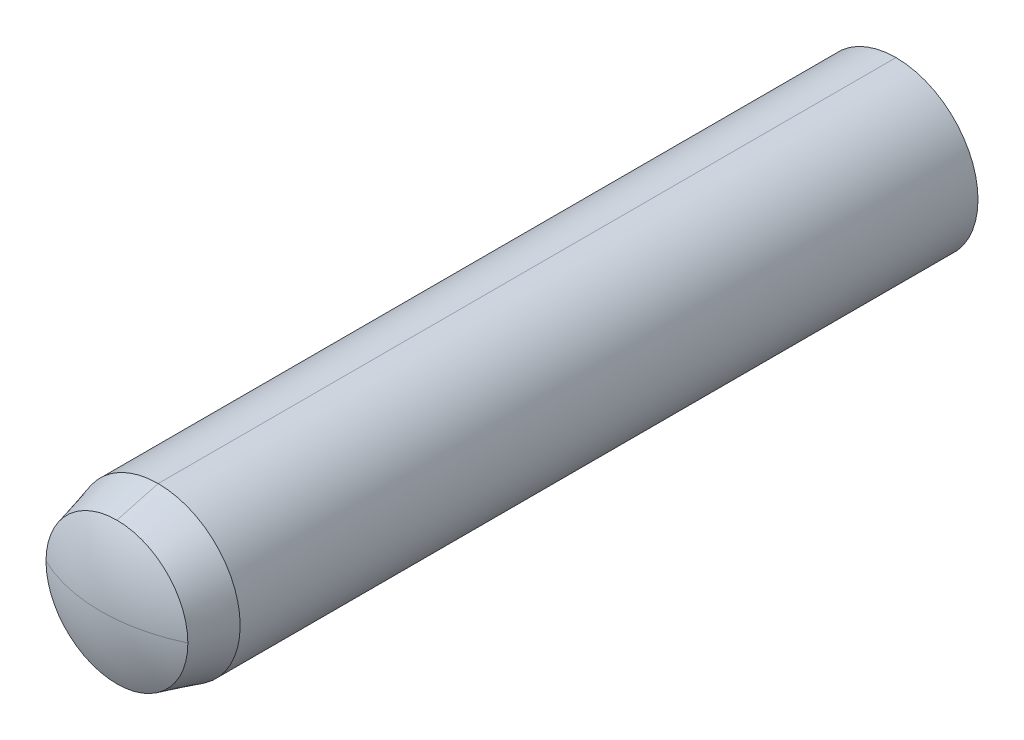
ISO-10303-21;
HEADER;
FILE_DESCRIPTION(('STEP AP214'),'2;1');
FILE_NAME('part.step','',(''),(''),'','','');
FILE_SCHEMA(('AUTOMOTIVE_DESIGN { 1 0 10303 214 1 1 1 1 }'));
ENDSEC;
DATA;
#1=APPLICATION_CONTEXT('core data for automotive mechanical design processes');
#2=APPLICATION_PROTOCOL_DEFINITION('international standard','automotive_design',2000,#1);
#3=PRODUCT_CONTEXT('',#1,'mechanical');
#4=PRODUCT('Part','Part','',(#3));
#5=PRODUCT_RELATED_PRODUCT_CATEGORY('part','',(#4));
#6=PRODUCT_DEFINITION_FORMATION('','',#4);
#7=PRODUCT_DEFINITION_CONTEXT('part definition',#1,'design');
#8=PRODUCT_DEFINITION('design','',#6,#7);
#9=PRODUCT_DEFINITION_SHAPE('','',#8);
#10=(LENGTH_UNIT() NAMED_UNIT(*) SI_UNIT(.MILLI.,.METRE.));
#11=(NAMED_UNIT(*) PLANE_ANGLE_UNIT() SI_UNIT($,.RADIAN.));
#12=(NAMED_UNIT(*) SI_UNIT($,.STERADIAN.) SOLID_ANGLE_UNIT());
#13=UNCERTAINTY_MEASURE_WITH_UNIT(LENGTH_MEASURE(1.E-05),#10,'distance_accuracy_value','');
#14=(GEOMETRIC_REPRESENTATION_CONTEXT(3) GLOBAL_UNCERTAINTY_ASSIGNED_CONTEXT((#13)) GLOBAL_UNIT_ASSIGNED_CONTEXT((#10,
#11,#12)) REPRESENTATION_CONTEXT('',''));
#15=CARTESIAN_POINT('',(0.,0.,0.));
#16=DIRECTION('',(0.,0.,1.));
#17=DIRECTION('',(1.,0.,0.));
#18=AXIS2_PLACEMENT_3D('',#15,#16,#17);
#19=CARTESIAN_POINT('',(0.,0.,9.6));
#20=DIRECTION('',(0.,0.,1.));
#21=DIRECTION('',(0.,1.,0.));
#22=AXIS2_PLACEMENT_3D('',#19,#20,#21);
#23=CYLINDRICAL_SURFACE('',#22,2.);
#24=CARTESIAN_POINT('',(0.,0.,18.6));
#25=DIRECTION('',(0.,0.,1.));
#26=DIRECTION('',(0.,-1.,0.));
#27=AXIS2_PLACEMENT_3D('',#24,#25,#26);
#28=CIRCLE('',#27,2.);
#29=CARTESIAN_POINT('',(0.,-2.,18.6));
#30=VERTEX_POINT('',#29);
#31=CARTESIAN_POINT('',(0.,2.,18.6));
#32=VERTEX_POINT('',#31);
#33=EDGE_CURVE('E102',#30,#32,#28,.T.);
#34=ORIENTED_EDGE('',*,*,#33,.F.);
#35=DIRECTION('',(0.,0.,-1.));
#36=VECTOR('',#35,1.);
#37=CARTESIAN_POINT('',(0.,-2.,18.6));
#38=LINE('',#37,#36);
#39=CARTESIAN_POINT('',(0.,-2.,0.6));
#40=VERTEX_POINT('',#39);
#41=EDGE_CURVE('E25',#30,#40,#38,.T.);
#42=ORIENTED_EDGE('',*,*,#41,.T.);
#43=CARTESIAN_POINT('',(0.,0.,0.6));
#44=DIRECTION('',(0.,0.,-1.));
#45=DIRECTION('',(1.,0.,0.));
#46=AXIS2_PLACEMENT_3D('',#43,#44,#45);
#47=CIRCLE('',#46,2.);
#48=CARTESIAN_POINT('',(2.,0.,0.6));
#49=VERTEX_POINT('',#48);
#50=EDGE_CURVE('E144',#49,#40,#47,.T.);
#51=ORIENTED_EDGE('',*,*,#50,.F.);
#52=CARTESIAN_POINT('',(0.,0.,0.6));
#53=DIRECTION('',(0.,0.,-1.));
#54=DIRECTION('',(0.,1.,0.));
#55=AXIS2_PLACEMENT_3D('',#52,#53,#54);
#56=CIRCLE('',#55,2.);
#57=CARTESIAN_POINT('',(0.,2.,0.6));
#58=VERTEX_POINT('',#57);
#59=EDGE_CURVE('E131',#58,#49,#56,.T.);
#60=ORIENTED_EDGE('',*,*,#59,.F.);
#61=DIRECTION('',(0.,0.,1.));
#62=VECTOR('',#61,1.);
#63=CARTESIAN_POINT('',(0.,2.,0.6));
#64=LINE('',#63,#62);
#65=EDGE_CURVE('E11',#58,#32,#64,.T.);
#66=ORIENTED_EDGE('',*,*,#65,.T.);
#67=EDGE_LOOP('',(#34,#42,#51,#60,#66));
#68=FACE_BOUND('',#67,.T.);
#69=ADVANCED_FACE('F16',(#68),#23,.T.);
#70=CARTESIAN_POINT('',(0.,0.,9.6));
#71=DIRECTION('',(0.,0.,1.));
#72=DIRECTION('',(0.,1.,0.));
#73=AXIS2_PLACEMENT_3D('',#70,#71,#72);
#74=CYLINDRICAL_SURFACE('',#73,2.);
#75=CARTESIAN_POINT('',(0.,0.,0.6));
#76=DIRECTION('',(0.,0.,-1.));
#77=DIRECTION('',(-1.,0.,0.));
#78=AXIS2_PLACEMENT_3D('',#75,#76,#77);
#79=CIRCLE('',#78,2.);
#80=CARTESIAN_POINT('',(-2.,0.,0.6));
#81=VERTEX_POINT('',#80);
#82=EDGE_CURVE('E135',#81,#58,#79,.T.);
#83=ORIENTED_EDGE('',*,*,#82,.F.);
#84=CARTESIAN_POINT('',(0.,0.,0.6));
#85=DIRECTION('',(0.,0.,-1.));
#86=DIRECTION('',(0.,-1.,0.));
#87=AXIS2_PLACEMENT_3D('',#84,#85,#86);
#88=CIRCLE('',#87,2.);
#89=EDGE_CURVE('E149',#40,#81,#88,.T.);
#90=ORIENTED_EDGE('',*,*,#89,.F.);
#91=ORIENTED_EDGE('',*,*,#41,.F.);
#92=CARTESIAN_POINT('',(0.,0.,18.6));
#93=DIRECTION('',(0.,0.,1.));
#94=DIRECTION('',(0.,1.,0.));
#95=AXIS2_PLACEMENT_3D('',#92,#93,#94);
#96=CIRCLE('',#95,2.);
#97=EDGE_CURVE('E100',#32,#30,#96,.T.);
#98=ORIENTED_EDGE('',*,*,#97,.F.);
#99=ORIENTED_EDGE('',*,*,#65,.F.);
#100=EDGE_LOOP('',(#83,#90,#91,#98,#99));
#101=FACE_BOUND('',#100,.T.);
#102=ADVANCED_FACE('F159',(#101),#74,.T.);
#103=CARTESIAN_POINT('',(0.,0.,19.10318541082));
#104=DIRECTION('',(0.,0.,-1.));
#105=DIRECTION('',(0.,1.,0.));
#106=AXIS2_PLACEMENT_3D('',#103,#104,#105);
#107=CONICAL_SURFACE('',#106,1.865171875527,0.2617993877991);
#108=ORIENTED_EDGE('',*,*,#97,.T.);
#109=DIRECTION('',(0.,-0.258819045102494,-0.965925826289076));
#110=VECTOR('',#109,1.);
#111=CARTESIAN_POINT('',(0.,-1.730343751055,19.60637082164));
#112=LINE('',#111,#110);
#113=CARTESIAN_POINT('',(0.,-1.730343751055,19.60637082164));
#114=VERTEX_POINT('',#113);
#115=EDGE_CURVE('E97',#114,#30,#112,.T.);
#116=ORIENTED_EDGE('',*,*,#115,.F.);
#117=CARTESIAN_POINT('',(0.,0.,19.60637082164));
#118=DIRECTION('',(0.,0.,1.));
#119=DIRECTION('',(-1.,0.,0.));
#120=AXIS2_PLACEMENT_3D('',#117,#118,#119);
#121=CIRCLE('',#120,1.730343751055);
#122=CARTESIAN_POINT('',(-1.730343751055,0.,19.60637082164));
#123=VERTEX_POINT('',#122);
#124=EDGE_CURVE('E99',#123,#114,#121,.T.);
#125=ORIENTED_EDGE('',*,*,#124,.F.);
#126=CARTESIAN_POINT('',(0.,0.,19.60637082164));
#127=DIRECTION('',(0.,0.,1.));
#128=DIRECTION('',(0.,1.,0.));
#129=AXIS2_PLACEMENT_3D('',#126,#127,#128);
#130=CIRCLE('',#129,1.730343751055);
#131=CARTESIAN_POINT('',(0.,1.730343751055,19.60637082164));
#132=VERTEX_POINT('',#131);
#133=EDGE_CURVE('E117',#132,#123,#130,.T.);
#134=ORIENTED_EDGE('',*,*,#133,.F.);
#135=DIRECTION('',(0.,-0.258819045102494,0.965925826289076));
#136=VECTOR('',#135,1.);
#137=CARTESIAN_POINT('',(0.,2.,18.6));
#138=LINE('',#137,#136);
#139=EDGE_CURVE('E55',#32,#132,#138,.T.);
#140=ORIENTED_EDGE('',*,*,#139,.F.);
#141=EDGE_LOOP('',(#108,#116,#125,#134,#140));
#142=FACE_BOUND('',#141,.T.);
#143=ADVANCED_FACE('F98',(#142),#107,.T.);
#144=CARTESIAN_POINT('',(0.,0.,19.10318541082));
#145=DIRECTION('',(0.,0.,-1.));
#146=DIRECTION('',(0.,1.,0.));
#147=AXIS2_PLACEMENT_3D('',#144,#145,#146);
#148=CONICAL_SURFACE('',#147,1.865171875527,0.2617993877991);
#149=CARTESIAN_POINT('',(0.,0.,19.60637082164));
#150=DIRECTION('',(0.,0.,1.));
#151=DIRECTION('',(1.,0.,0.));
#152=AXIS2_PLACEMENT_3D('',#149,#150,#151);
#153=CIRCLE('',#152,1.730343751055);
#154=CARTESIAN_POINT('',(1.730343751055,0.,19.60637082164));
#155=VERTEX_POINT('',#154);
#156=EDGE_CURVE('E106',#155,#132,#153,.T.);
#157=ORIENTED_EDGE('',*,*,#156,.F.);
#158=CARTESIAN_POINT('',(0.,0.,19.60637082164));
#159=DIRECTION('',(0.,0.,1.));
#160=DIRECTION('',(0.,-1.,0.));
#161=AXIS2_PLACEMENT_3D('',#158,#159,#160);
#162=CIRCLE('',#161,1.730343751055);
#163=EDGE_CURVE('E67',#114,#155,#162,.T.);
#164=ORIENTED_EDGE('',*,*,#163,.F.);
#165=ORIENTED_EDGE('',*,*,#115,.T.);
#166=ORIENTED_EDGE('',*,*,#33,.T.);
#167=ORIENTED_EDGE('',*,*,#139,.T.);
#168=EDGE_LOOP('',(#157,#164,#165,#166,#167));
#169=FACE_BOUND('',#168,.T.);
#170=ADVANCED_FACE('F104',(#169),#148,.T.);
#171=CARTESIAN_POINT('',(0.,0.,16.));
#172=DIRECTION('',(0.,1.,0.));
#173=DIRECTION('',(0.901592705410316,0.,-0.432585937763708));
#174=AXIS2_PLACEMENT_3D('',#171,#172,#173);
#175=SPHERICAL_SURFACE('',#174,4.);
#176=ORIENTED_EDGE('',*,*,#124,.T.);
#177=ORIENTED_EDGE('',*,*,#163,.T.);
#178=CARTESIAN_POINT('',(0.,0.,16.));
#179=DIRECTION('',(0.,1.,0.));
#180=DIRECTION('',(-0.432585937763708,0.,0.901592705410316));
#181=AXIS2_PLACEMENT_3D('',#178,#179,#180);
#182=CIRCLE('',#181,4.);
#183=EDGE_CURVE('E110',#123,#155,#182,.T.);
#184=ORIENTED_EDGE('',*,*,#183,.F.);
#185=EDGE_LOOP('',(#176,#177,#184));
#186=FACE_BOUND('',#185,.T.);
#187=ADVANCED_FACE('F109',(#186),#175,.T.);
#188=CARTESIAN_POINT('',(0.,0.,16.));
#189=DIRECTION('',(0.,1.,0.));
#190=DIRECTION('',(0.,0.,-1.));
#191=AXIS2_PLACEMENT_3D('',#188,#189,#190);
#192=SPHERICAL_SURFACE('',#191,4.);
#193=ORIENTED_EDGE('',*,*,#156,.T.);
#194=ORIENTED_EDGE('',*,*,#133,.T.);
#195=ORIENTED_EDGE('',*,*,#183,.T.);
#196=EDGE_LOOP('',(#193,#194,#195));
#197=FACE_BOUND('',#196,.T.);
#198=ADVANCED_FACE('F175',(#197),#192,.T.);
#199=CARTESIAN_POINT('',(2.031761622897,0.1278276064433,0.622471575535));
#200=CARTESIAN_POINT('',(1.419309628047,0.08929539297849,0.2325137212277));
#201=CARTESIAN_POINT('',(0.7253758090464,0.04563677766,0.01991295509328));
#202=CARTESIAN_POINT('',(0.,0.,0.));
#203=CARTESIAN_POINT('',(2.110426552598,-1.12251564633,0.622471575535));
#204=CARTESIAN_POINT('',(1.474261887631,-0.784145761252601,0.2325137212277));
#205=CARTESIAN_POINT('',(0.7534606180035,-0.4007584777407,0.01991295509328));
#206=CARTESIAN_POINT('',(0.,0.,0.));
#207=CARTESIAN_POINT('',(1.252815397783,-2.035778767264,0.622471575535));
#208=CARTESIAN_POINT('',(0.875168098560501,-1.422115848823,0.2325137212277));
#209=CARTESIAN_POINT('',(0.4472778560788,-0.7268100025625,0.01991295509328));
#210=CARTESIAN_POINT('',(0.,0.,0.));
#211=CARTESIAN_POINT('',(0.,-2.035778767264,0.622471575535));
#212=CARTESIAN_POINT('',(0.,-1.422115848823,0.2325137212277));
#213=CARTESIAN_POINT('',(0.,-0.7268100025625,0.01991295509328));
#214=CARTESIAN_POINT('',(0.,0.,0.));
#215=CARTESIAN_POINT('',(-1.252815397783,-2.035778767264,0.622471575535));
#216=CARTESIAN_POINT('',(-0.875168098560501,-1.422115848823,0.2325137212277));
#217=CARTESIAN_POINT('',(-0.4472778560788,-0.7268100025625,0.01991295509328));
#218=CARTESIAN_POINT('',(0.,0.,0.));
#219=CARTESIAN_POINT('',(-2.110426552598,-1.12251564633,0.622471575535));
#220=CARTESIAN_POINT('',(-1.474261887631,-0.784145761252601,0.2325137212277));
#221=CARTESIAN_POINT('',(-0.7534606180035,-0.4007584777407,0.01991295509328));
#222=CARTESIAN_POINT('',(0.,0.,0.));
#223=CARTESIAN_POINT('',(-2.031761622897,0.1278276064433,0.622471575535));
#224=CARTESIAN_POINT('',(-1.419309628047,0.08929539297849,0.2325137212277));
#225=CARTESIAN_POINT('',(-0.7253758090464,0.04563677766,0.01991295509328));
#226=CARTESIAN_POINT('',(0.,0.,0.));
#227=(BOUNDED_SURFACE() B_SPLINE_SURFACE(3,3,((#199,#200,#201,#202),(#203,#204,#205,#206),(#207,
#208,#209,#210),(#211,#212,#213,#214),(#215,#216,#217,#218),(#219,#220,#221,#222),(#223,#224,
#225,#226)),.UNSPECIFIED.,.F.,.F.,.F.) B_SPLINE_SURFACE_WITH_KNOTS((4,3,4),(4,4),(0.,1.,2.),(0.,
1.),.UNSPECIFIED.) GEOMETRIC_REPRESENTATION_ITEM() RATIONAL_B_SPLINE_SURFACE(((1.209059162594,
1.179997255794,1.179997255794,1.209059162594),(0.9547916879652,0.9318415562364,0.9318415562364,
0.9547916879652),(0.9547916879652,0.9318415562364,0.9318415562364,0.9547916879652),
(1.209059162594,1.179997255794,1.179997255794,1.209059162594),(0.9547916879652,0.9318415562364,
0.9318415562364,0.9547916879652),(0.9547916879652,0.9318415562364,0.9318415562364,
0.9547916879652),(1.209059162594,1.179997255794,1.179997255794,1.209059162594))) REPRESENTATION_ITEM('') SURFACE());
#228=CARTESIAN_POINT('',(0.1095498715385,0.,3.998499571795));
#229=DIRECTION('',(0.,1.,0.));
#230=DIRECTION('',(-0.0273874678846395,0.,-0.999624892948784));
#231=AXIS2_PLACEMENT_3D('',#228,#229,#230);
#232=CIRCLE('',#231,4.);
#233=CARTESIAN_POINT('',(0.,0.,0.));
#234=VERTEX_POINT('',#233);
#235=EDGE_CURVE('E136',#234,#81,#232,.T.);
#236=CARTESIAN_POINT('',(-0.1095498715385,0.,3.998499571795));
#237=DIRECTION('',(0.,1.,0.));
#238=DIRECTION('',(0.527387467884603,0.,-0.849624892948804));
#239=AXIS2_PLACEMENT_3D('',#236,#237,#238);
#240=CIRCLE('',#239,4.);
#241=EDGE_CURVE('E134',#49,#234,#240,.T.);
#242=ORIENTED_EDGE('',*,*,#50,.T.);
#243=ORIENTED_EDGE('',*,*,#89,.T.);
#244=ORIENTED_EDGE('',*,*,#235,.F.);
#245=ORIENTED_EDGE('',*,*,#241,.F.);
#246=EDGE_LOOP('',(#242,#243,#244,#245));
#247=FACE_BOUND('',#246,.T.);
#248=ADVANCED_FACE('F177',(#247),#227,.T.);
#249=CARTESIAN_POINT('',(-2.031761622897,-0.1278276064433,0.622471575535));
#250=CARTESIAN_POINT('',(-1.419309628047,-0.08929539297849,0.2325137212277));
#251=CARTESIAN_POINT('',(-0.7253758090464,-0.04563677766,0.01991295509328));
#252=CARTESIAN_POINT('',(0.,0.,0.));
#253=CARTESIAN_POINT('',(-2.110426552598,1.12251564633,0.622471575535));
#254=CARTESIAN_POINT('',(-1.474261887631,0.784145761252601,0.2325137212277));
#255=CARTESIAN_POINT('',(-0.7534606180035,0.4007584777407,0.01991295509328));
#256=CARTESIAN_POINT('',(0.,0.,0.));
#257=CARTESIAN_POINT('',(-1.252815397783,2.035778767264,0.622471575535));
#258=CARTESIAN_POINT('',(-0.875168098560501,1.422115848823,0.2325137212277));
#259=CARTESIAN_POINT('',(-0.4472778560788,0.7268100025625,0.01991295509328));
#260=CARTESIAN_POINT('',(0.,0.,0.));
#261=CARTESIAN_POINT('',(0.,2.035778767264,0.622471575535));
#262=CARTESIAN_POINT('',(0.,1.422115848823,0.2325137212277));
#263=CARTESIAN_POINT('',(0.,0.7268100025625,0.01991295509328));
#264=CARTESIAN_POINT('',(0.,0.,0.));
#265=CARTESIAN_POINT('',(1.252815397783,2.035778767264,0.622471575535));
#266=CARTESIAN_POINT('',(0.875168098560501,1.422115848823,0.2325137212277));
#267=CARTESIAN_POINT('',(0.4472778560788,0.7268100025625,0.01991295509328));
#268=CARTESIAN_POINT('',(0.,0.,0.));
#269=CARTESIAN_POINT('',(2.110426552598,1.12251564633,0.622471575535));
#270=CARTESIAN_POINT('',(1.474261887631,0.784145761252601,0.2325137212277));
#271=CARTESIAN_POINT('',(0.7534606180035,0.4007584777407,0.01991295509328));
#272=CARTESIAN_POINT('',(0.,0.,0.));
#273=CARTESIAN_POINT('',(2.031761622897,-0.1278276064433,0.622471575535));
#274=CARTESIAN_POINT('',(1.419309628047,-0.08929539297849,0.2325137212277));
#275=CARTESIAN_POINT('',(0.7253758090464,-0.04563677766,0.01991295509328));
#276=CARTESIAN_POINT('',(0.,0.,0.));
#277=(BOUNDED_SURFACE() B_SPLINE_SURFACE(3,3,((#249,#250,#251,#252),(#253,#254,#255,#256),(#257,
#258,#259,#260),(#261,#262,#263,#264),(#265,#266,#267,#268),(#269,#270,#271,#272),(#273,#274,
#275,#276)),.UNSPECIFIED.,.F.,.F.,.F.) B_SPLINE_SURFACE_WITH_KNOTS((4,3,4),(4,4),(0.,1.,2.),(0.,
1.),.UNSPECIFIED.) GEOMETRIC_REPRESENTATION_ITEM() RATIONAL_B_SPLINE_SURFACE(((1.209059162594,
1.179997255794,1.179997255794,1.209059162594),(0.9547916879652,0.9318415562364,0.9318415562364,
0.9547916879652),(0.9547916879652,0.9318415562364,0.9318415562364,0.9547916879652),
(1.209059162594,1.179997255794,1.179997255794,1.209059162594),(0.9547916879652,0.9318415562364,
0.9318415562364,0.9547916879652),(0.9547916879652,0.9318415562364,0.9318415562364,
0.9547916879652),(1.209059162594,1.179997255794,1.179997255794,1.209059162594))) REPRESENTATION_ITEM('') SURFACE());
#278=ORIENTED_EDGE('',*,*,#235,.T.);
#279=ORIENTED_EDGE('',*,*,#82,.T.);
#280=ORIENTED_EDGE('',*,*,#59,.T.);
#281=ORIENTED_EDGE('',*,*,#241,.T.);
#282=EDGE_LOOP('',(#278,#279,#280,#281));
#283=FACE_BOUND('',#282,.T.);
#284=ADVANCED_FACE('F184',(#283),#277,.T.);
#285=CLOSED_SHELL('',(#69,#102,#143,#170,#187,#198,#248,#284));
#286=MANIFOLD_SOLID_BREP('B1',#285);
#287=ADVANCED_BREP_SHAPE_REPRESENTATION('',(#18,#286),#14);
#288=SHAPE_DEFINITION_REPRESENTATION(#9,#287);
ENDSEC;
END-ISO-10303-21;
